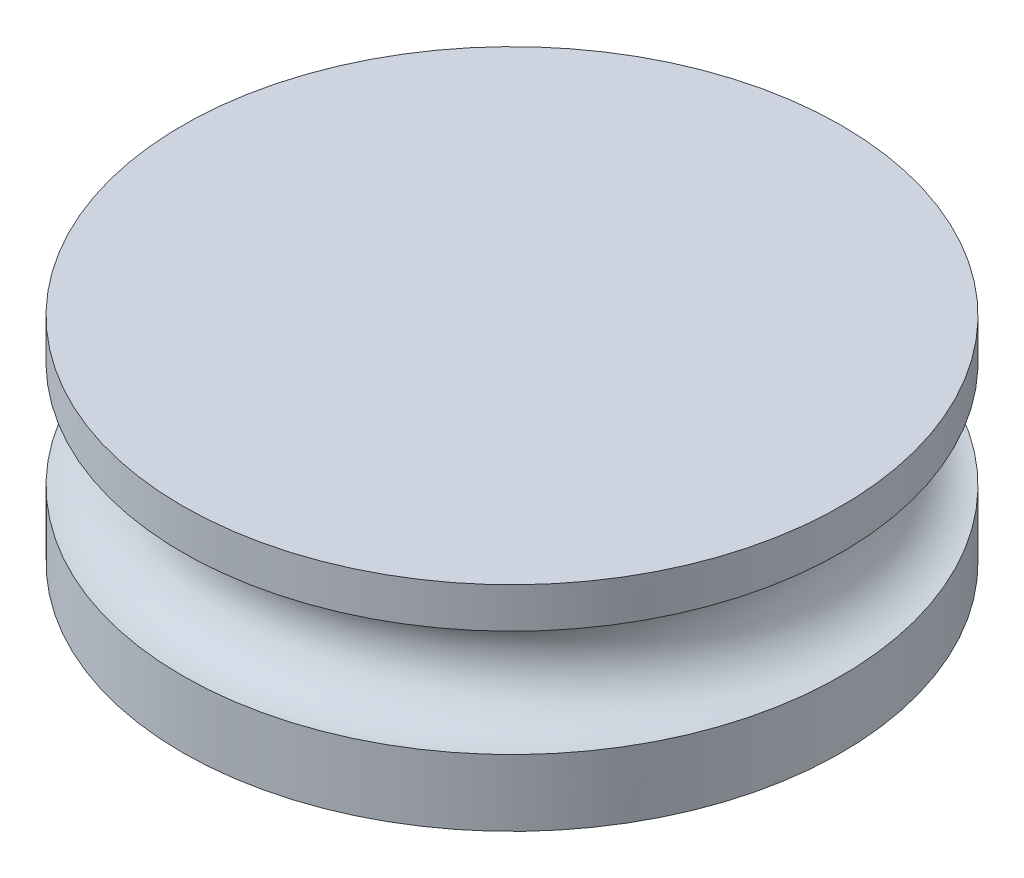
ISO-10303-21;
HEADER;
FILE_DESCRIPTION(('STEP AP214'),'2;1');
FILE_NAME('part.step','',(''),(''),'','','');
FILE_SCHEMA(('AUTOMOTIVE_DESIGN { 1 0 10303 214 1 1 1 1 }'));
ENDSEC;
DATA;
#1=APPLICATION_CONTEXT('core data for automotive mechanical design processes');
#2=APPLICATION_PROTOCOL_DEFINITION('international standard','automotive_design',2000,#1);
#3=PRODUCT_CONTEXT('',#1,'mechanical');
#4=PRODUCT('Part','Part','',(#3));
#5=PRODUCT_RELATED_PRODUCT_CATEGORY('part','',(#4));
#6=PRODUCT_DEFINITION_FORMATION('','',#4);
#7=PRODUCT_DEFINITION_CONTEXT('part definition',#1,'design');
#8=PRODUCT_DEFINITION('design','',#6,#7);
#9=PRODUCT_DEFINITION_SHAPE('','',#8);
#10=(LENGTH_UNIT() NAMED_UNIT(*) SI_UNIT(.MILLI.,.METRE.));
#11=(NAMED_UNIT(*) PLANE_ANGLE_UNIT() SI_UNIT($,.RADIAN.));
#12=(NAMED_UNIT(*) SI_UNIT($,.STERADIAN.) SOLID_ANGLE_UNIT());
#13=UNCERTAINTY_MEASURE_WITH_UNIT(LENGTH_MEASURE(1.E-05),#10,'distance_accuracy_value','');
#14=(GEOMETRIC_REPRESENTATION_CONTEXT(3) GLOBAL_UNCERTAINTY_ASSIGNED_CONTEXT((#13)) GLOBAL_UNIT_ASSIGNED_CONTEXT((#10,
#11,#12)) REPRESENTATION_CONTEXT('',''));
#15=CARTESIAN_POINT('',(0.,0.,0.));
#16=DIRECTION('',(0.,0.,1.));
#17=DIRECTION('',(1.,0.,0.));
#18=AXIS2_PLACEMENT_3D('',#15,#16,#17);
#19=CARTESIAN_POINT('',(0.,50.8,0.));
#20=DIRECTION('',(0.,-1.,0.));
#21=DIRECTION('',(0.,0.,-1.));
#22=AXIS2_PLACEMENT_3D('',#19,#20,#21);
#23=CYLINDRICAL_SURFACE('',#22,78.3645950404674);
#24=CARTESIAN_POINT('',(0.,0.,0.));
#25=DIRECTION('',(0.,1.,0.));
#26=DIRECTION('',(0.,0.,1.));
#27=AXIS2_PLACEMENT_3D('',#24,#25,#26);
#28=CIRCLE('',#27,78.3645950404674);
#29=CARTESIAN_POINT('',(0.,0.,78.3645950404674));
#30=VERTEX_POINT('',#29);
#31=EDGE_CURVE('E32',#30,#30,#28,.T.);
#32=ORIENTED_EDGE('',*,*,#31,.T.);
#33=EDGE_LOOP('',(#32));
#34=FACE_BOUND('',#33,.T.);
#35=CARTESIAN_POINT('',(0.,15.8223800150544,0.));
#36=DIRECTION('',(0.,1.,0.));
#37=DIRECTION('',(0.,0.,1.));
#38=AXIS2_PLACEMENT_3D('',#35,#36,#37);
#39=CIRCLE('',#38,78.3645950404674);
#40=CARTESIAN_POINT('',(0.,15.8223800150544,78.3645950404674));
#41=VERTEX_POINT('',#40);
#42=EDGE_CURVE('E28',#41,#41,#39,.T.);
#43=ORIENTED_EDGE('',*,*,#42,.F.);
#44=EDGE_LOOP('',(#43));
#45=FACE_BOUND('',#44,.T.);
#46=ADVANCED_FACE('F25',(#34,#45),#23,.T.);
#47=CARTESIAN_POINT('',(0.,0.,0.));
#48=DIRECTION('',(0.,1.,0.));
#49=DIRECTION('',(0.,0.,1.));
#50=AXIS2_PLACEMENT_3D('',#47,#48,#49);
#51=PLANE('',#50);
#52=ORIENTED_EDGE('',*,*,#31,.F.);
#53=EDGE_LOOP('',(#52));
#54=FACE_BOUND('',#53,.T.);
#55=ADVANCED_FACE('F48',(#54),#51,.F.);
#56=CARTESIAN_POINT('',(0.,28.5223800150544,0.));
#57=DIRECTION('',(0.,-1.,0.));
#58=DIRECTION('',(0.,0.,-1.));
#59=AXIS2_PLACEMENT_3D('',#56,#57,#58);
#60=TOROIDAL_SURFACE('',#59,78.3645950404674,12.7);
#61=CARTESIAN_POINT('',(0.,41.2223800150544,0.));
#62=DIRECTION('',(0.,-1.,0.));
#63=DIRECTION('',(0.,0.,-1.));
#64=AXIS2_PLACEMENT_3D('',#61,#62,#63);
#65=CIRCLE('',#64,78.3645950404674);
#66=CARTESIAN_POINT('',(0.,41.2223800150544,-78.3645950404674));
#67=VERTEX_POINT('',#66);
#68=EDGE_CURVE('E38',#67,#67,#65,.T.);
#69=ORIENTED_EDGE('',*,*,#68,.T.);
#70=EDGE_LOOP('',(#69));
#71=FACE_BOUND('',#70,.T.);
#72=ORIENTED_EDGE('',*,*,#42,.T.);
#73=EDGE_LOOP('',(#72));
#74=FACE_BOUND('',#73,.T.);
#75=ADVANCED_FACE('F45',(#71,#74),#60,.F.);
#76=CARTESIAN_POINT('',(0.,50.8,0.));
#77=DIRECTION('',(0.,1.,0.));
#78=DIRECTION('',(0.,0.,1.));
#79=AXIS2_PLACEMENT_3D('',#76,#77,#78);
#80=PLANE('',#79);
#81=CARTESIAN_POINT('',(0.,50.8,0.));
#82=DIRECTION('',(0.,1.,0.));
#83=DIRECTION('',(0.,0.,1.));
#84=AXIS2_PLACEMENT_3D('',#81,#82,#83);
#85=CIRCLE('',#84,78.3645950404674);
#86=CARTESIAN_POINT('',(0.,50.8,78.3645950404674));
#87=VERTEX_POINT('',#86);
#88=EDGE_CURVE('E10',#87,#87,#85,.T.);
#89=ORIENTED_EDGE('',*,*,#88,.T.);
#90=EDGE_LOOP('',(#89));
#91=FACE_BOUND('',#90,.T.);
#92=ADVANCED_FACE('F58',(#91),#80,.T.);
#93=ORIENTED_EDGE('',*,*,#88,.F.);
#94=EDGE_LOOP('',(#93));
#95=FACE_BOUND('',#94,.T.);
#96=ORIENTED_EDGE('',*,*,#68,.F.);
#97=EDGE_LOOP('',(#96));
#98=FACE_BOUND('',#97,.T.);
#99=ADVANCED_FACE('F50',(#95,#98),#23,.T.);
#100=CLOSED_SHELL('',(#46,#55,#75,#92,#99));
#101=MANIFOLD_SOLID_BREP('B2',#100);
#102=ADVANCED_BREP_SHAPE_REPRESENTATION('',(#18,#101),#14);
#103=SHAPE_DEFINITION_REPRESENTATION(#9,#102);
ENDSEC;
END-ISO-10303-21;
